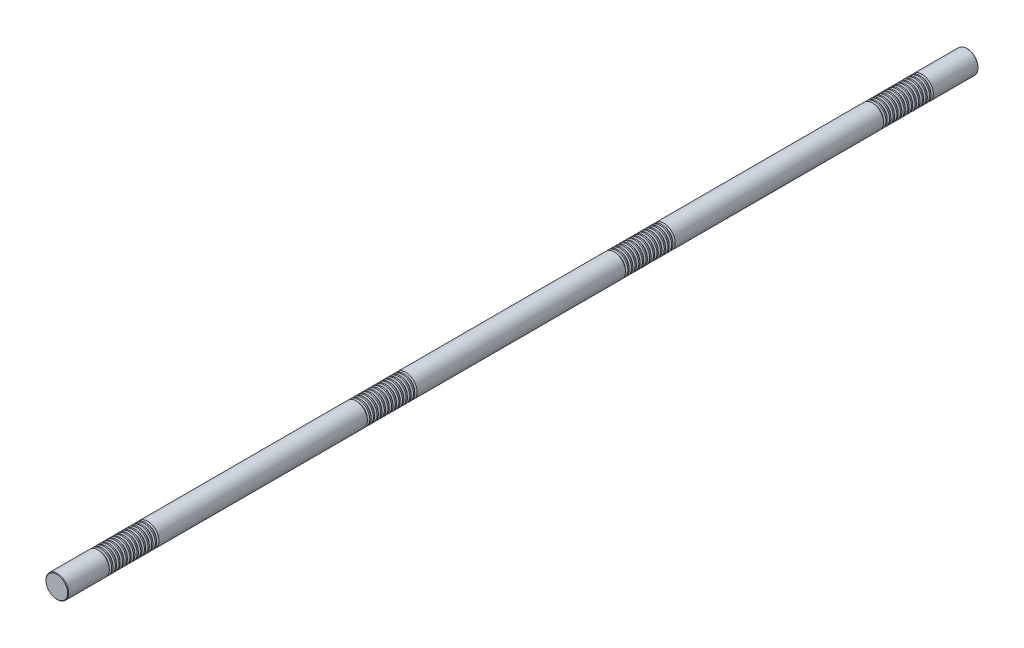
from build123d import *

# Parameters (mm, degrees)
SKETCH1_R           = 25
BOSS_EXTRUDE1_DEPTH = 1000
CHAMFER1_SIZE       = 1.25
LPATTERN1_COUNT     = 14
LPATTERN1_PITCH     = 8
LPATTERN2_COUNT     = 4
LPATTERN2_PITCH     = 567


with BuildPart() as part:
    # Sketch1 → Boss-Extrude1 (new, symmetric)
    with BuildSketch(Plane.XY):
        Circle(SKETCH1_R)
    extrude(amount=BOSS_EXTRUDE1_DEPTH, both=True)

    # Chamfer1
    chamfer1_edges = [part.edges().sort_by_distance(p)[0] for p in [
        (-25, 0, -1000),
        (-25, 0, 1000),
    ]]
    chamfer(chamfer1_edges, length=CHAMFER1_SIZE)

    # Sketch2 → Cut-Revolve1 (revolve, cut)
    with BuildSketch(Plane(origin=(0, 0, 0), x_dir=(0, 0, -1), z_dir=(1, 0, 0)), mode=Mode.PRIVATE) as cut_revolve1_sk:
        Polygon((900.602885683, 25), (895.397114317, 25), (896.602885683, 20.5), (899.397114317, 20.5), align=None)
    cut_revolve1 = revolve(cut_revolve1_sk.sketch.rotate(Axis((0, 0, 1000), (0, 0, -1)), 90), axis=Axis((0, 0, 1000), (0, 0, -1)), mode=Mode.SUBTRACT)

    # LPattern1: Cut-Revolve1 ×14
    with Locations(*[(0, 0, i * LPATTERN1_PITCH) for i in range(1, LPATTERN1_COUNT)]):
        add(cut_revolve1, mode=Mode.SUBTRACT)

    # LPattern2: Cut-Revolve1 ×4
    with Locations(*[(0, 0, i * LPATTERN2_PITCH) for i in range(1, LPATTERN2_COUNT)]):
        add(cut_revolve1, mode=Mode.SUBTRACT)

    # LPattern2 copy 1 sketch → LPattern2 copy 1 (revolve, cut)
    with BuildSketch(Plane(origin=(0, 0, 575), x_dir=(0, 0, -1), z_dir=(1, 0, 0))):
        Polygon((900.602885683, 25), (895.397114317, 25), (896.602885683, 20.5), (899.397114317, 20.5), align=None)
    revolve(axis=Axis((0, 0, 1575), (0, 0, -1)), mode=Mode.SUBTRACT)

    # LPattern2 copy 2 sketch → LPattern2 copy 2 (revolve, cut)
    with BuildSketch(Plane(origin=(0, 0, 1142), x_dir=(0, 0, -1), z_dir=(1, 0, 0))):
        Polygon((900.602885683, 25), (895.397114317, 25), (896.602885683, 20.5), (899.397114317, 20.5), align=None)
    revolve(axis=Axis((0, 0, 2142), (0, 0, -1)), mode=Mode.SUBTRACT)

    # LPattern2 copy 3 sketch → LPattern2 copy 3 (revolve, cut)
    with BuildSketch(Plane(origin=(0, 0, 1709), x_dir=(0, 0, -1), z_dir=(1, 0, 0))):
        Polygon((900.602885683, 25), (895.397114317, 25), (896.602885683, 20.5), (899.397114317, 20.5), align=None)
    revolve(axis=Axis((0, 0, 2709), (0, 0, -1)), mode=Mode.SUBTRACT)

    # LPattern2 copy 4 sketch → LPattern2 copy 4 (revolve, cut)
    with BuildSketch(Plane(origin=(0, 0, 583), x_dir=(0, 0, -1), z_dir=(1, 0, 0))):
        Polygon((900.602885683, 25), (895.397114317, 25), (896.602885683, 20.5), (899.397114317, 20.5), align=None)
    revolve(axis=Axis((0, 0, 1583), (0, 0, -1)), mode=Mode.SUBTRACT)

    # LPattern2 copy 5 sketch → LPattern2 copy 5 (revolve, cut)
    with BuildSketch(Plane(origin=(0, 0, 1150), x_dir=(0, 0, -1), z_dir=(1, 0, 0))):
        Polygon((900.602885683, 25), (895.397114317, 25), (896.602885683, 20.5), (899.397114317, 20.5), align=None)
    revolve(axis=Axis((0, 0, 2150), (0, 0, -1)), mode=Mode.SUBTRACT)

    # LPattern2 copy 6 sketch → LPattern2 copy 6 (revolve, cut)
    with BuildSketch(Plane(origin=(0, 0, 1717), x_dir=(0, 0, -1), z_dir=(1, 0, 0))):
        Polygon((900.602885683, 25), (895.397114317, 25), (896.602885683, 20.5), (899.397114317, 20.5), align=None)
    revolve(axis=Axis((0, 0, 2717), (0, 0, -1)), mode=Mode.SUBTRACT)

    # LPattern2 copy 7 sketch → LPattern2 copy 7 (revolve, cut)
    with BuildSketch(Plane(origin=(0, 0, 591), x_dir=(0, 0, -1), z_dir=(1, 0, 0))):
        Polygon((900.602885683, 25), (895.397114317, 25), (896.602885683, 20.5), (899.397114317, 20.5), align=None)
    revolve(axis=Axis((0, 0, 1591), (0, 0, -1)), mode=Mode.SUBTRACT)

    # LPattern2 copy 8 sketch → LPattern2 copy 8 (revolve, cut)
    with BuildSketch(Plane(origin=(0, 0, 1158), x_dir=(0, 0, -1), z_dir=(1, 0, 0))):
        Polygon((900.602885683, 25), (895.397114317, 25), (896.602885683, 20.5), (899.397114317, 20.5), align=None)
    revolve(axis=Axis((0, 0, 2158), (0, 0, -1)), mode=Mode.SUBTRACT)

    # LPattern2 copy 9 sketch → LPattern2 copy 9 (revolve, cut)
    with BuildSketch(Plane(origin=(0, 0, 1725), x_dir=(0, 0, -1), z_dir=(1, 0, 0))):
        Polygon((900.602885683, 25), (895.397114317, 25), (896.602885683, 20.5), (899.397114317, 20.5), align=None)
    revolve(axis=Axis((0, 0, 2725), (0, 0, -1)), mode=Mode.SUBTRACT)

    # LPattern2 copy 10 sketch → LPattern2 copy 10 (revolve, cut)
    with BuildSketch(Plane(origin=(0, 0, 599), x_dir=(0, 0, -1), z_dir=(1, 0, 0))):
        Polygon((900.602885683, 25), (895.397114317, 25), (896.602885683, 20.5), (899.397114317, 20.5), align=None)
    revolve(axis=Axis((0, 0, 1599), (0, 0, -1)), mode=Mode.SUBTRACT)

    # LPattern2 copy 11 sketch → LPattern2 copy 11 (revolve, cut)
    with BuildSketch(Plane(origin=(0, 0, 1166), x_dir=(0, 0, -1), z_dir=(1, 0, 0))):
        Polygon((900.602885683, 25), (895.397114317, 25), (896.602885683, 20.5), (899.397114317, 20.5), align=None)
    revolve(axis=Axis((0, 0, 2166), (0, 0, -1)), mode=Mode.SUBTRACT)

    # LPattern2 copy 12 sketch → LPattern2 copy 12 (revolve, cut)
    with BuildSketch(Plane(origin=(0, 0, 1733), x_dir=(0, 0, -1), z_dir=(1, 0, 0))):
        Polygon((900.602885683, 25), (895.397114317, 25), (896.602885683, 20.5), (899.397114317, 20.5), align=None)
    revolve(axis=Axis((0, 0, 2733), (0, 0, -1)), mode=Mode.SUBTRACT)

    # LPattern2 copy 13 sketch → LPattern2 copy 13 (revolve, cut)
    with BuildSketch(Plane(origin=(0, 0, 607), x_dir=(0, 0, -1), z_dir=(1, 0, 0))):
        Polygon((900.602885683, 25), (895.397114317, 25), (896.602885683, 20.5), (899.397114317, 20.5), align=None)
    revolve(axis=Axis((0, 0, 1607), (0, 0, -1)), mode=Mode.SUBTRACT)

    # LPattern2 copy 14 sketch → LPattern2 copy 14 (revolve, cut)
    with BuildSketch(Plane(origin=(0, 0, 1174), x_dir=(0, 0, -1), z_dir=(1, 0, 0))):
        Polygon((900.602885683, 25), (895.397114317, 25), (896.602885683, 20.5), (899.397114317, 20.5), align=None)
    revolve(axis=Axis((0, 0, 2174), (0, 0, -1)), mode=Mode.SUBTRACT)

    # LPattern2 copy 15 sketch → LPattern2 copy 15 (revolve, cut)
    with BuildSketch(Plane(origin=(0, 0, 1741), x_dir=(0, 0, -1), z_dir=(1, 0, 0))):
        Polygon((900.602885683, 25), (895.397114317, 25), (896.602885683, 20.5), (899.397114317, 20.5), align=None)
    revolve(axis=Axis((0, 0, 2741), (0, 0, -1)), mode=Mode.SUBTRACT)

    # LPattern2 copy 16 sketch → LPattern2 copy 16 (revolve, cut)
    with BuildSketch(Plane(origin=(0, 0, 615), x_dir=(0, 0, -1), z_dir=(1, 0, 0))):
        Polygon((900.602885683, 25), (895.397114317, 25), (896.602885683, 20.5), (899.397114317, 20.5), align=None)
    revolve(axis=Axis((0, 0, 1615), (0, 0, -1)), mode=Mode.SUBTRACT)

    # LPattern2 copy 17 sketch → LPattern2 copy 17 (revolve, cut)
    with BuildSketch(Plane(origin=(0, 0, 1182), x_dir=(0, 0, -1), z_dir=(1, 0, 0))):
        Polygon((900.602885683, 25), (895.397114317, 25), (896.602885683, 20.5), (899.397114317, 20.5), align=None)
    revolve(axis=Axis((0, 0, 2182), (0, 0, -1)), mode=Mode.SUBTRACT)

    # LPattern2 copy 18 sketch → LPattern2 copy 18 (revolve, cut)
    with BuildSketch(Plane(origin=(0, 0, 1749), x_dir=(0, 0, -1), z_dir=(1, 0, 0))):
        Polygon((900.602885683, 25), (895.397114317, 25), (896.602885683, 20.5), (899.397114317, 20.5), align=None)
    revolve(axis=Axis((0, 0, 2749), (0, 0, -1)), mode=Mode.SUBTRACT)

    # LPattern2 copy 19 sketch → LPattern2 copy 19 (revolve, cut)
    with BuildSketch(Plane(origin=(0, 0, 623), x_dir=(0, 0, -1), z_dir=(1, 0, 0))):
        Polygon((900.602885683, 25), (895.397114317, 25), (896.602885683, 20.5), (899.397114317, 20.5), align=None)
    revolve(axis=Axis((0, 0, 1623), (0, 0, -1)), mode=Mode.SUBTRACT)

    # LPattern2 copy 20 sketch → LPattern2 copy 20 (revolve, cut)
    with BuildSketch(Plane(origin=(0, 0, 1190), x_dir=(0, 0, -1), z_dir=(1, 0, 0))):
        Polygon((900.602885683, 25), (895.397114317, 25), (896.602885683, 20.5), (899.397114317, 20.5), align=None)
    revolve(axis=Axis((0, 0, 2190), (0, 0, -1)), mode=Mode.SUBTRACT)

    # LPattern2 copy 21 sketch → LPattern2 copy 21 (revolve, cut)
    with BuildSketch(Plane(origin=(0, 0, 1757), x_dir=(0, 0, -1), z_dir=(1, 0, 0))):
        Polygon((900.602885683, 25), (895.397114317, 25), (896.602885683, 20.5), (899.397114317, 20.5), align=None)
    revolve(axis=Axis((0, 0, 2757), (0, 0, -1)), mode=Mode.SUBTRACT)

    # LPattern2 copy 22 sketch → LPattern2 copy 22 (revolve, cut)
    with BuildSketch(Plane(origin=(0, 0, 631), x_dir=(0, 0, -1), z_dir=(1, 0, 0))):
        Polygon((900.602885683, 25), (895.397114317, 25), (896.602885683, 20.5), (899.397114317, 20.5), align=None)
    revolve(axis=Axis((0, 0, 1631), (0, 0, -1)), mode=Mode.SUBTRACT)

    # LPattern2 copy 23 sketch → LPattern2 copy 23 (revolve, cut)
    with BuildSketch(Plane(origin=(0, 0, 1198), x_dir=(0, 0, -1), z_dir=(1, 0, 0))):
        Polygon((900.602885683, 25), (895.397114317, 25), (896.602885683, 20.5), (899.397114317, 20.5), align=None)
    revolve(axis=Axis((0, 0, 2198), (0, 0, -1)), mode=Mode.SUBTRACT)

    # LPattern2 copy 24 sketch → LPattern2 copy 24 (revolve, cut)
    with BuildSketch(Plane(origin=(0, 0, 1765), x_dir=(0, 0, -1), z_dir=(1, 0, 0))):
        Polygon((900.602885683, 25), (895.397114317, 25), (896.602885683, 20.5), (899.397114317, 20.5), align=None)
    revolve(axis=Axis((0, 0, 2765), (0, 0, -1)), mode=Mode.SUBTRACT)

    # LPattern2 copy 25 sketch → LPattern2 copy 25 (revolve, cut)
    with BuildSketch(Plane(origin=(0, 0, 639), x_dir=(0, 0, -1), z_dir=(1, 0, 0))):
        Polygon((900.602885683, 25), (895.397114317, 25), (896.602885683, 20.5), (899.397114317, 20.5), align=None)
    revolve(axis=Axis((0, 0, 1639), (0, 0, -1)), mode=Mode.SUBTRACT)

    # LPattern2 copy 26 sketch → LPattern2 copy 26 (revolve, cut)
    with BuildSketch(Plane(origin=(0, 0, 1206), x_dir=(0, 0, -1), z_dir=(1, 0, 0))):
        Polygon((900.602885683, 25), (895.397114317, 25), (896.602885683, 20.5), (899.397114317, 20.5), align=None)
    revolve(axis=Axis((0, 0, 2206), (0, 0, -1)), mode=Mode.SUBTRACT)

    # LPattern2 copy 27 sketch → LPattern2 copy 27 (revolve, cut)
    with BuildSketch(Plane(origin=(0, 0, 1773), x_dir=(0, 0, -1), z_dir=(1, 0, 0))):
        Polygon((900.602885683, 25), (895.397114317, 25), (896.602885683, 20.5), (899.397114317, 20.5), align=None)
    revolve(axis=Axis((0, 0, 2773), (0, 0, -1)), mode=Mode.SUBTRACT)

    # LPattern2 copy 28 sketch → LPattern2 copy 28 (revolve, cut)
    with BuildSketch(Plane(origin=(0, 0, 647), x_dir=(0, 0, -1), z_dir=(1, 0, 0))):
        Polygon((900.602885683, 25), (895.397114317, 25), (896.602885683, 20.5), (899.397114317, 20.5), align=None)
    revolve(axis=Axis((0, 0, 1647), (0, 0, -1)), mode=Mode.SUBTRACT)

    # LPattern2 copy 29 sketch → LPattern2 copy 29 (revolve, cut)
    with BuildSketch(Plane(origin=(0, 0, 1214), x_dir=(0, 0, -1), z_dir=(1, 0, 0))):
        Polygon((900.602885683, 25), (895.397114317, 25), (896.602885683, 20.5), (899.397114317, 20.5), align=None)
    revolve(axis=Axis((0, 0, 2214), (0, 0, -1)), mode=Mode.SUBTRACT)

    # LPattern2 copy 30 sketch → LPattern2 copy 30 (revolve, cut)
    with BuildSketch(Plane(origin=(0, 0, 1781), x_dir=(0, 0, -1), z_dir=(1, 0, 0))):
        Polygon((900.602885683, 25), (895.397114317, 25), (896.602885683, 20.5), (899.397114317, 20.5), align=None)
    revolve(axis=Axis((0, 0, 2781), (0, 0, -1)), mode=Mode.SUBTRACT)

    # LPattern2 copy 31 sketch → LPattern2 copy 31 (revolve, cut)
    with BuildSketch(Plane(origin=(0, 0, 655), x_dir=(0, 0, -1), z_dir=(1, 0, 0))):
        Polygon((900.602885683, 25), (895.397114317, 25), (896.602885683, 20.5), (899.397114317, 20.5), align=None)
    revolve(axis=Axis((0, 0, 1655), (0, 0, -1)), mode=Mode.SUBTRACT)

    # LPattern2 copy 32 sketch → LPattern2 copy 32 (revolve, cut)
    with BuildSketch(Plane(origin=(0, 0, 1222), x_dir=(0, 0, -1), z_dir=(1, 0, 0))):
        Polygon((900.602885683, 25), (895.397114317, 25), (896.602885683, 20.5), (899.397114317, 20.5), align=None)
    revolve(axis=Axis((0, 0, 2222), (0, 0, -1)), mode=Mode.SUBTRACT)

    # LPattern2 copy 33 sketch → LPattern2 copy 33 (revolve, cut)
    with BuildSketch(Plane(origin=(0, 0, 1789), x_dir=(0, 0, -1), z_dir=(1, 0, 0))):
        Polygon((900.602885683, 25), (895.397114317, 25), (896.602885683, 20.5), (899.397114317, 20.5), align=None)
    revolve(axis=Axis((0, 0, 2789), (0, 0, -1)), mode=Mode.SUBTRACT)

    # LPattern2 copy 34 sketch → LPattern2 copy 34 (revolve, cut)
    with BuildSketch(Plane(origin=(0, 0, 663), x_dir=(0, 0, -1), z_dir=(1, 0, 0))):
        Polygon((900.602885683, 25), (895.397114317, 25), (896.602885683, 20.5), (899.397114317, 20.5), align=None)
    revolve(axis=Axis((0, 0, 1663), (0, 0, -1)), mode=Mode.SUBTRACT)

    # LPattern2 copy 35 sketch → LPattern2 copy 35 (revolve, cut)
    with BuildSketch(Plane(origin=(0, 0, 1230), x_dir=(0, 0, -1), z_dir=(1, 0, 0))):
        Polygon((900.602885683, 25), (895.397114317, 25), (896.602885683, 20.5), (899.397114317, 20.5), align=None)
    revolve(axis=Axis((0, 0, 2230), (0, 0, -1)), mode=Mode.SUBTRACT)

    # LPattern2 copy 36 sketch → LPattern2 copy 36 (revolve, cut)
    with BuildSketch(Plane(origin=(0, 0, 1797), x_dir=(0, 0, -1), z_dir=(1, 0, 0))):
        Polygon((900.602885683, 25), (895.397114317, 25), (896.602885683, 20.5), (899.397114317, 20.5), align=None)
    revolve(axis=Axis((0, 0, 2797), (0, 0, -1)), mode=Mode.SUBTRACT)

    # LPattern2 copy 37 sketch → LPattern2 copy 37 (revolve, cut)
    with BuildSketch(Plane(origin=(0, 0, 671), x_dir=(0, 0, -1), z_dir=(1, 0, 0))):
        Polygon((900.602885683, 25), (895.397114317, 25), (896.602885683, 20.5), (899.397114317, 20.5), align=None)
    revolve(axis=Axis((0, 0, 1671), (0, 0, -1)), mode=Mode.SUBTRACT)

    # LPattern2 copy 38 sketch → LPattern2 copy 38 (revolve, cut)
    with BuildSketch(Plane(origin=(0, 0, 1238), x_dir=(0, 0, -1), z_dir=(1, 0, 0))):
        Polygon((900.602885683, 25), (895.397114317, 25), (896.602885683, 20.5), (899.397114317, 20.5), align=None)
    revolve(axis=Axis((0, 0, 2238), (0, 0, -1)), mode=Mode.SUBTRACT)

    # LPattern2 copy 39 sketch → LPattern2 copy 39 (revolve, cut)
    with BuildSketch(Plane(origin=(0, 0, 1805), x_dir=(0, 0, -1), z_dir=(1, 0, 0))):
        Polygon((900.602885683, 25), (895.397114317, 25), (896.602885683, 20.5), (899.397114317, 20.5), align=None)
    revolve(axis=Axis((0, 0, 2805), (0, 0, -1)), mode=Mode.SUBTRACT)


solid = part.part
